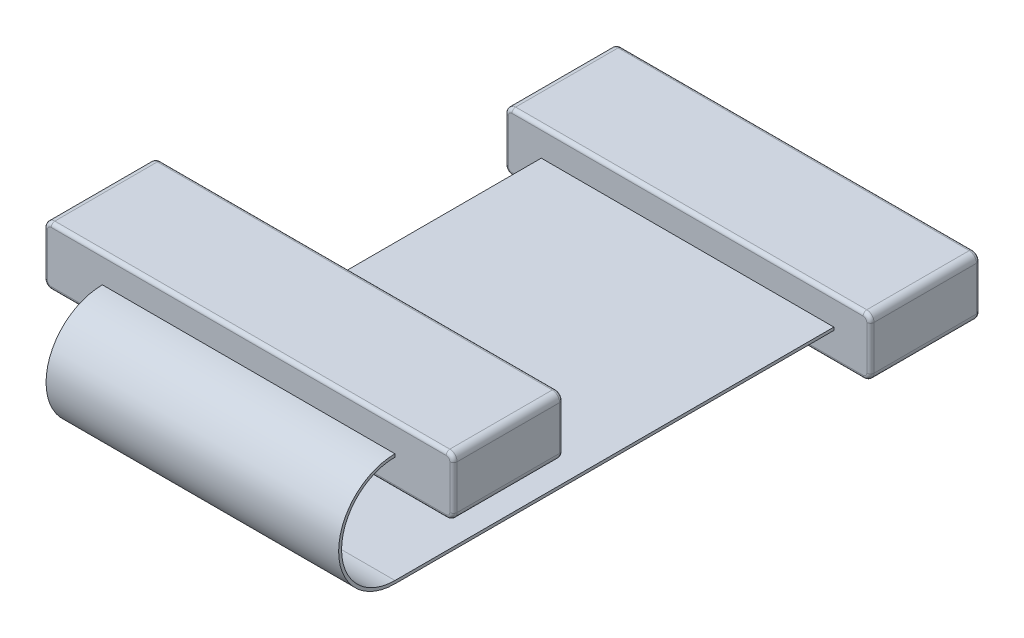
from build123d import *

# Parameters (mm, degrees)
SKETCH3_W           = 56
SKETCH3_H           = 8
BASE_EXTRUDE_DEPTH  = 15
SKETCH4_W           = 51
SKETCH4_H           = 3
CUT_EXTRUDE1_DEPTH  = 10
CHAMFER1_SIZE       = 0.5
BOSS_THICKEN1_T1    = 0.2
BOSS_THICKEN1_T2    = 0.2
SKETCH7_W           = 50
SKETCH7_H           = 8
BOSS_EXTRUDE1_DEPTH = 15
SKETCH8_W           = 46
SKETCH8_H           = 4
CUT_EXTRUDE2_DEPTH  = 10
CHAMFER2_SIZE       = 0.5
FILLET1_R           = 1
FILLET2_R           = 0.5


with BuildPart() as part:
    # Sketch3 → Base-Extrude (new body)
    with BuildSketch(Plane.XY):
        Rectangle(SKETCH3_W, SKETCH3_H)
    extrude(amount=BASE_EXTRUDE_DEPTH)

    # Sketch4 → Cut-Extrude1 (cut)
    with BuildSketch(Plane(origin=(0, 0, 0), x_dir=(-1, 0, 0), z_dir=(0, 0, -1))):
        Rectangle(SKETCH4_W, SKETCH4_H)
    extrude(amount=-CUT_EXTRUDE1_DEPTH, mode=Mode.SUBTRACT)

    # Chamfer1
    chamfer1_edges = [part.edges().sort_by_distance(p)[0] for p in [
        (0, 1.5, 0),
        (25.5, 0, 0),
        (0, -1.5, 0),
        (-25.5, 0, 0),
    ]]
    chamfer(chamfer1_edges, length=CHAMFER1_SIZE)

    # Surface1: a surface, the sketch's curves swept along a path
    with BuildLine(Plane.XY.offset(15), mode=Mode.PRIVATE) as surface1_1_profile:
        Line((20, 0), (-20, 0))
    with BuildLine(Plane(origin=(0, 0, 0), x_dir=(0, 0, -1), z_dir=(1, 0, 0)), mode=Mode.PRIVATE) as surface1_1_along:
        Line((45, -15), (-15, -15))
        ThreePointArc((-15, -15), (-22.5, -7.5), (-15, 0))
    surface1_1 = Shell.sweep(surface1_1_profile.wire(), surface1_1_along.wire())
    add(Solid.thicken(surface1_1, BOSS_THICKEN1_T1))
    add(Solid.thicken(surface1_1, -BOSS_THICKEN1_T2))

    # Sketch7 → Boss-Extrude1 (add)
    with BuildSketch(Plane(origin=(0, 0, -45), x_dir=(-1, 0, 0), z_dir=(0, 0, -1))):
        with Locations((0, -15)):
            Rectangle(SKETCH7_W, SKETCH7_H)
    extrude(amount=BOSS_EXTRUDE1_DEPTH)

    # Sketch8 → Cut-Extrude2 (cut)
    with BuildSketch(Plane(origin=(23.517513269, -30.656569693, -60), x_dir=(-1, 0, 0), z_dir=(0, 0, -1))):
        with Locations((23.517513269, 15.656569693)):
            Rectangle(SKETCH8_W, SKETCH8_H)
    extrude(amount=-CUT_EXTRUDE2_DEPTH, mode=Mode.SUBTRACT)

    # Chamfer2
    chamfer2_edges = [part.edges().sort_by_distance(p)[0] for p in [
        (0, -17, -60),
        (-23, -15, -60),
        (0, -13, -60),
        (23, -15, -60),
    ]]
    chamfer(chamfer2_edges, length=CHAMFER2_SIZE)

    # Fillet1
    fillet1_edges = [part.edges().sort_by_distance(p)[0] for p in [
        (25, -19, -52.5),
        (-25, -19, -52.5),
        (25, -11, -52.5),
        (-25, -11, -52.5),
        (-28, 4, 7.5),
        (28, 4, 7.5),
        (-28, -4, 7.5),
        (28, -4, 7.5),
    ]]
    fillet(fillet1_edges, radius=FILLET1_R)

    # Fillet2
    fillet2_edges = [part.edges().sort_by_distance(p)[0] for p in [
        (0, -19, -60),
        (24.707106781, -18.707106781, -60),
        (-24.707106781, -18.707106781, -60),
        (25, -15, -60),
        (-25, -15, -60),
        (24.707106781, -11.292893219, -60),
        (-24.707106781, -11.292893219, -60),
        (0, -11, -60),
        (0, -19, -45),
        (24.707106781, -18.707106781, -45),
        (-24.707106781, -18.707106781, -45),
        (25, -15, -45),
        (-25, -15, -45),
        (24.707106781, -11.292893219, -45),
        (-24.707106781, -11.292893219, -45),
        (0, -11, -45),
        (0, 4, 15),
        (-27.707106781, 3.707106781, 15),
        (27.707106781, 3.707106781, 15),
        (-28, 0, 15),
        (28, 0, 15),
        (-27.707106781, -3.707106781, 15),
        (27.707106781, -3.707106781, 15),
        (0, -4, 15),
        (0, 4, 0),
        (-27.707106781, 3.707106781, 0),
        (27.707106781, 3.707106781, 0),
        (-28, 0, 0),
        (28, 0, 0),
        (-27.707106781, -3.707106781, 0),
        (27.707106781, -3.707106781, 0),
        (0, -4, 0),
    ]]
    fillet(fillet2_edges, radius=FILLET2_R)


solid = part.part
